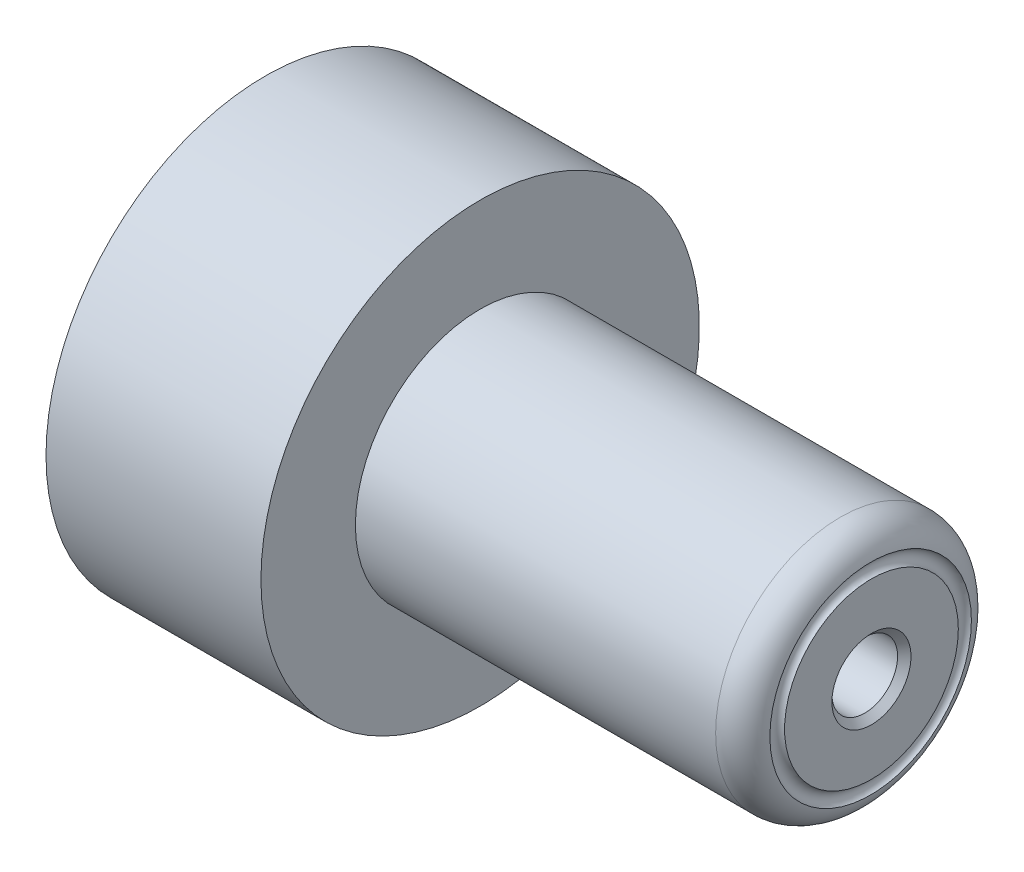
from build123d import *

# Parameters (mm, degrees)
SKETCH2_R          = 1.2065
CUT_EXTRUDE1_DEPTH = 2.54
SKETCH3_R          = 1.665
CUT_EXTRUDE2_DEPTH = 35.51889437
CHAMFER1_SIZE      = 0.34
SKETCH4_R          = 0.381


with BuildPart() as part:
    # Sketch1 → Revolve1 (revolve)
    with BuildSketch(Plane.XY, mode=Mode.PRIVATE) as revolve1_sk:
        with BuildLine():
            Line((0, 3.9751), (0, 11.1125))
            Line((0, 11.1125), (10.8966, 11.1125))
            Line((10.8966, 11.1125), (10.8966, 6.3246))
            Line((10.8966, 6.3246), (29.1592, 6.3246))
            ThreePointArc((29.1592, 6.3246), (30.272751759, 5.863351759), (30.734, 4.7498))
            Line((30.734, 4.7498), (30.734, 0))
            Line((30.734, 0), (21.8948, 0))
            Line((21.8948, 0), (21.8948, 3.9751))
            Line((21.8948, 3.9751), (0, 3.9751))
        make_face()
    revolve(revolve1_sk.sketch.rotate(Axis((0, 0, 0), (1, 0, 0)), 90), axis=Axis((0, 0, 0), (1, 0, 0)))

    # Sketch2 → Cut-Extrude1 (cut)
    with BuildSketch(Plane.ZY):
        with Locations((-6.7437, 0)):
            Circle(SKETCH2_R)
        with Locations(Location((6.7437, 0, 0), (0, 0, 180))):
            Circle(SKETCH2_R)
    extrude(amount=-CUT_EXTRUDE1_DEPTH, mode=Mode.SUBTRACT)

    # Sketch3 → Cut-Extrude2 (cut, through all)
    with BuildSketch(Plane(origin=(30.734, 0, 0), x_dir=(0, 0, -1), z_dir=(1, 0, 0))):
        Circle(SKETCH3_R)
    extrude(amount=-CUT_EXTRUDE2_DEPTH, mode=Mode.SUBTRACT)

    # Chamfer1
    chamfer1_edges = [part.edges().sort_by_distance(p)[0] for p in [
        (30.734, 0, 1.665),
    ]]
    chamfer(chamfer1_edges, length=CHAMFER1_SIZE)

    # Sketch4 → Cut-Revolve1 (revolve, cut)
    with BuildSketch(Plane.XY, mode=Mode.PRIVATE) as cut_revolve1_sk:
        with Locations((30.857, 4.765)):
            Circle(SKETCH4_R)
    revolve(cut_revolve1_sk.sketch.rotate(Axis((0, 0, 0), (1, 0, 0)), 90), axis=Axis((0, 0, 0), (1, 0, 0)), mode=Mode.SUBTRACT)


solid = part.part
